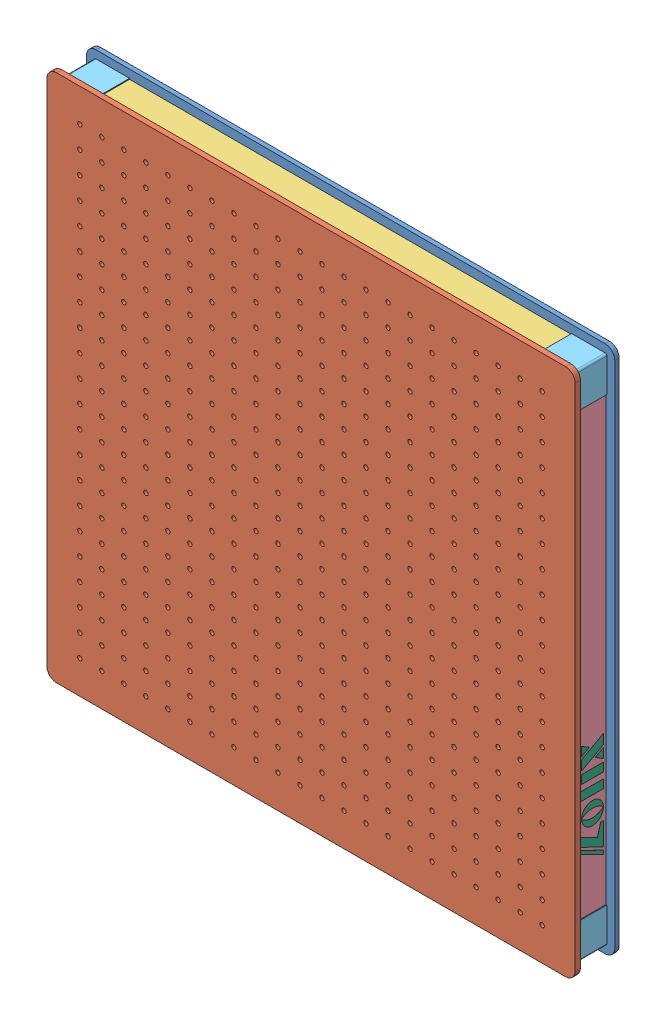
SolidWorks assembly NTBB66-50 台面.SLDASM, configuration 默认 (file format 9000). Lengths in mm.
Overall size (600 600 50).
12 component instances, 6 part files, 18 mates.
Components (placement in the parent):
- 底面-1: 底面.SLDPRT [默认] at (-135.9825 34.8604 -136.0445) size (600 600 5)
- 台面-2: 台面.SLDPRT [默认] at (-135.9825 34.8604 -92.0445) size (600 600 6)
- 铝塑板1-1: 铝塑板1.SLDPRT [默认] at (-135.9825 324.8604 -111.5445) x (1 0 0) z (0 -1 0) size (566 39 3)
- 铝塑板2-1: 铝塑板2.SLDPRT [默认] at (154.0175 34.8604 -111.5445) x (0 1 0) z (-1 0 0) size (566 39 3)
- 铝塑板2-2: 铝塑板2.SLDPRT [默认] at (-422.9825 34.8604 -111.5445) x (0 1 0) z (-1 0 0) size (566 39 3)
- 铝塑板1-2: 铝塑板1.SLDPRT [默认] at (-135.9825 -252.1396 -111.5445) x (1 0 0) z (0 -1 0) size (566 39 3)
- 不锈钢包角80x80-1: 不锈钢包角80x80.SLDPRT [默认] at (-426.9825 325.8604 -131.0445) x (0 -1 0) z (0 0 1) size (40 40 39)
- 不锈钢包角80x80-2: 不锈钢包角80x80.SLDPRT [默认] at (155.0175 325.8604 -92.0445) x (0 -1 0) z (0 0 -1) size (40 40 39)
- 不锈钢包角80x80-3: 不锈钢包角80x80.SLDPRT [默认] at (155.0175 -256.1396 -131.0445) x (0 1 0) z (0 0 1) size (40 40 39)
- 不锈钢包角80x80-4: 不锈钢包角80x80.SLDPRT [默认] at (-426.9825 -256.1396 -92.0445) x (0 1 0) z (0 0 -1) size (40 40 39)
- Zolix-LOGO-台面50mm厚-1: Zolix-LOGO-台面50mm厚.SLDPRT [默认] at (154.0175 -131.9134 -121.1227) x (0 1 0) z (1 0 0) size (119.25 34.38 0.05)
- Zolix-LOGO-台面50mm厚-2: Zolix-LOGO-台面50mm厚.SLDPRT [默认] at (-425.9825 201.6342 -121.1227) x (0 -1 0) z (-1 0 0) size (119.25 34.38 0.05)
Mates (geometry in assembly coordinates):
- 宽度7: width aligned: plane of 底面-1 through (-424.9825 -265.1396 -131.0445) normal (0 -1 0); plane of 底面-1 through (-424.9825 334.8604 -131.0445) normal (0 1 0); plane of 台面-2 through (-424.9825 -265.1396 -86.0445) normal (0 -1 0); plane of 台面-2 through (-424.9825 334.8604 -86.0445) normal (0 1 0)
- 宽度8: width aligned: plane of 底面-1 through (164.0175 -254.1396 -131.0445) normal (1 0 0); plane of 底面-1 through (-435.9825 -254.1396 -131.0445) normal (-1 0 0); plane of 台面-2 through (164.0175 -254.1396 -86.0445) normal (1 0 0); plane of 台面-2 through (-435.9825 -254.1396 -86.0445) normal (-1 0 0)
- 重合9: coincident anti-aligned: plane of 台面-2 through (153.0175 -254.1396 -92.0445) normal (0 0 -1); plane of 铝塑板2-1 through (151.0175 -248.1396 -92.0445) normal (0 0 1)
- 宽度9: width aligned: plane of 底面-1 through (-424.9825 -265.1396 -131.0445) normal (0 -1 0); plane of 底面-1 through (-424.9825 334.8604 -131.0445) normal (0 1 0); plane of 铝塑板2-1 through (151.0175 -248.1396 -92.0445) normal (0 -1 0); plane of 铝塑板2-1 through (151.0175 317.8604 -92.0445) normal (0 1 0)
- 宽度10: width aligned: plane of 底面-1 through (164.0175 -254.1396 -131.0445) normal (1 0 0); plane of 底面-1 through (-435.9825 -254.1396 -131.0445) normal (-1 0 0); plane of 铝塑板1-1 through (147.0175 321.8604 -131.0445) normal (1 0 0); plane of 铝塑板1-1 through (-418.9825 321.8604 -131.0445) normal (-1 0 0)
- 重合18: coincident anti-aligned: plane of 铝塑板1-1 through (-135.9825 324.8604 -111.5445) normal (0 1 0); plane of 不锈钢包角80x80-1 through (-424.9825 324.8604 -92.0445) normal (0 -1 0)
- 重合19: coincident anti-aligned: plane of 铝塑板2-2 through (-425.9825 34.8604 -111.5445) normal (-1 0 0); plane of 不锈钢包角80x80-1 through (-425.9825 285.8604 -92.0445) normal (1 0 0)
- 重合20: coincident anti-aligned: plane of 台面-2 through (153.0175 -254.1396 -92.0445) normal (0 0 -1); plane of 不锈钢包角80x80-1 through (-424.9825 323.8604 -92.0445) normal (0 0 1)
- 重合21: coincident anti-aligned: plane of 底面-1 through (153.0175 323.8604 -131.0445) normal (0 0 1); plane of 不锈钢包角80x80-2 through (153.0175 323.8604 -131.0445) normal (0 0 -1)
- 重合22: coincident anti-aligned: plane of 底面-1 through (153.0175 323.8604 -131.0445) normal (0 0 1); plane of 铝塑板1-1 through (-418.9825 321.8604 -131.0445) normal (0 0 -1)
- 距离1: distance = 10 mm aligned: plane of 铝塑板2-2 through (-425.9825 34.8604 -111.5445) normal (-1 0 0); plane of 底面-1 through (-435.9825 -254.1396 -131.0445) normal (-1 0 0)
- 距离2: distance = 10 mm aligned: plane of 铝塑板1-1 through (-135.9825 324.8604 -111.5445) normal (0 1 0); plane of 底面-1 through (-424.9825 334.8604 -131.0445) normal (0 1 0)
- 重合23: coincident anti-aligned: plane of 铝塑板2-1 through (154.0175 34.8604 -111.5445) normal (1 0 0); plane of Zolix-LOGO-台面50mm厚-1 through (154.0175 -131.9134 -121.1227) normal (-1 0 0)
- 距离3: distance = 100 mm aligned: plane of Zolix-LOGO-台面50mm厚-1 through (154.0675 -165.1396 -96.5328) normal (0 -1 0); plane of 台面-2 through (-424.9825 -265.1396 -86.0445) normal (0 -1 0)
- 宽度11: width aligned: plane of 台面-2 through (153.0175 -254.1396 -86.0445) normal (0 0 1); plane of 底面-1 through (153.0175 323.8604 -136.0445) normal (0 0 -1); plane of Zolix-LOGO-台面50mm厚-1 through (154.0675 -165.1396 -93.8533) normal (0 0 1); plane of Zolix-LOGO-台面50mm厚-1 through (154.0675 -161.2859 -128.2358) normal (0 0 -1)
- 重合24: coincident anti-aligned: plane of 铝塑板2-2 through (-425.9825 34.8604 -111.5445) normal (-1 0 0); plane of Zolix-LOGO-台面50mm厚-2 through (-425.9825 201.6342 -122.0153) normal (1 0 0)
- 距离4: distance = 100 mm aligned: plane of 台面-2 through (-424.9825 334.8604 -86.0445) normal (0 1 0); plane of Zolix-LOGO-台面50mm厚-2 through (-426.0325 234.8604 -96.5328) normal (0 1 0)
- 宽度12: width aligned: plane of 台面-2 through (153.0175 -254.1396 -86.0445) normal (0 0 1); plane of 底面-1 through (153.0175 323.8604 -136.0445) normal (0 0 -1); plane of Zolix-LOGO-台面50mm厚-2 through (-426.0325 234.8604 -93.8533) normal (0 0 1); plane of Zolix-LOGO-台面50mm厚-2 through (-426.0325 231.0067 -128.2358) normal (0 0 -1)
